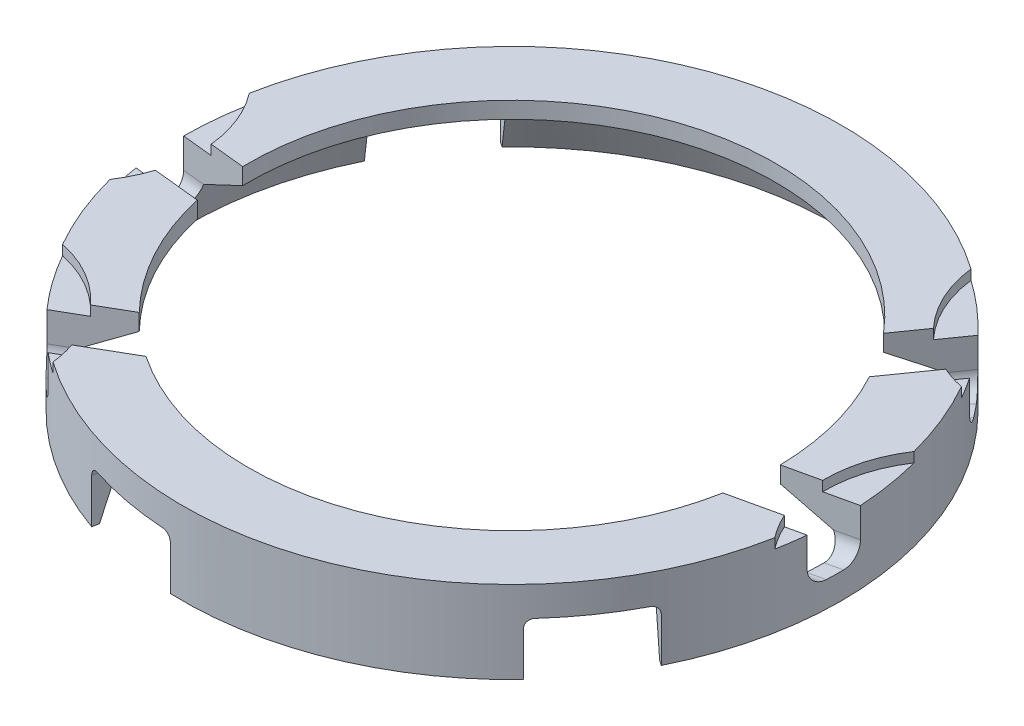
from build123d import *

# Parameters (mm, degrees)
CUT_EXTRUDE2_REACH = 307.713
CUT_EXTRUDE3_REACH = 293.287
CUT_EXTRUDE4_REACH = 298.591
CUT_EXTRUDE5_REACH = 309.152
CUT_EXTRUDE6_START = -3.81
SKETCH10_R         = 47.879
CUT_EXTRUDE6_DEPTH = 3.81
CUT_EXTRUDE7_DEPTH = 20.32
FILLET1_R          = 3.175


with BuildPart() as part:
    # Sketch2 → Revolve1 (revolve)
    with BuildSketch(Plane.XY, mode=Mode.PRIVATE) as revolve1_sk:
        Polygon((-101.6, 0), (-127, 0), (-127, -31.75), (-124.46, -31.75), (-118.450851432, -15.24), (-101.6, -6.35), align=None)
    revolve(revolve1_sk.sketch.rotate(Axis((0, 0, 0), (0, 1, 0)), 270), axis=Axis((0, 0, 0), (0, 1, 0)))

    # Sketch6 → Cut-Extrude2 (cut, up to next)
    with BuildSketch(Plane(origin=(-109.985226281, 0, 63.5), x_dir=(0.49999999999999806, 0, 0.8660254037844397), z_dir=(-0.8660254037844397, 0, 0.49999999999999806)), mode=Mode.PRIVATE) as cut_extrude2_sk1:
        with BuildLine():
            Line((24.918045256, 0), (44.476045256, 0))
            Line((44.476045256, 0), (44.476045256, -3.81))
            Line((44.476045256, -3.81), (44.476045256, -15.24))
            ThreePointArc((44.476045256, -15.24), (42.541778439, -19.909733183), (37.872045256, -21.844))
            Line((37.872045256, -21.844), (31.522045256, -21.844))
            ThreePointArc((31.522045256, -21.844), (26.852312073, -19.909733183), (24.918045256, -15.24))
            Line((24.918045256, -15.24), (24.918045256, -3.81))
            Line((24.918045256, -3.81), (24.918045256, 0))
        make_face()
    cut_extrude2_tool1 = extrude(cut_extrude2_sk1.sketch, amount=-CUT_EXTRUDE2_REACH, mode=Mode.PRIVATE) & part.part
    add(cut_extrude2_tool1.solids().sort_by_distance((-92.636704, -10.48912, 93.548523))[0], mode=Mode.SUBTRACT)

    # Sketch7 → Cut-Extrude3 (cut, up to next)
    with BuildSketch(Plane(origin=(-126.304280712, 0, -13.275114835), x_dir=(-0.10452846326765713, 0, 0.9945218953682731), z_dir=(-0.9945218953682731, 0, -0.10452846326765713)), mode=Mode.PRIVATE) as cut_extrude3_sk1:
        with BuildLine():
            Line((12.826833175, 0), (32.384833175, 0))
            Line((32.384833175, 0), (32.384833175, -3.81))
            Line((32.384833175, -3.81), (32.384833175, -15.24))
            ThreePointArc((32.384833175, -15.24), (30.450566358, -19.909733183), (25.780833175, -21.844))
            Line((25.780833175, -21.844), (19.430833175, -21.844))
            ThreePointArc((19.430833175, -21.844), (14.761099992, -19.909733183), (12.826833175, -15.24))
            Line((12.826833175, -15.24), (12.826833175, -3.81))
            Line((12.826833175, -3.81), (12.826833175, 0))
        make_face()
    cut_extrude3_tool1 = extrude(cut_extrude3_sk1.sketch, amount=-CUT_EXTRUDE3_REACH, mode=Mode.PRIVATE) & part.part
    add(cut_extrude3_tool1.solids().sort_by_distance((-128.667234, -10.48912, 9.206881))[0], mode=Mode.SUBTRACT)

    # Sketch8 → Cut-Extrude4 (cut, up to next)
    with BuildSketch(Plane(origin=(123.880999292, 0, -27.973165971), x_dir=(-0.22026114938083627, 0, -0.9754409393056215), z_dir=(0.9754409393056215, 0, -0.22026114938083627)), mode=Mode.PRIVATE) as cut_extrude4_sk1:
        with BuildLine():
            Line((-40.149833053, 0), (-20.591833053, 0))
            Line((-20.591833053, 0), (-20.591833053, -3.81))
            Line((-20.591833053, -3.81), (-20.591833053, -15.24))
            ThreePointArc((-20.591833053, -15.24), (-22.52609987, -19.909733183), (-27.195833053, -21.844))
            Line((-27.195833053, -21.844), (-33.545833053, -21.844))
            ThreePointArc((-33.545833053, -21.844), (-38.215566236, -19.909733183), (-40.149833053, -15.24))
            Line((-40.149833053, -15.24), (-40.149833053, -3.81))
            Line((-40.149833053, -3.81), (-40.149833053, 0))
        make_face()
    cut_extrude4_tool1 = extrude(cut_extrude4_sk1.sketch, amount=-CUT_EXTRUDE4_REACH, mode=Mode.PRIVATE) & part.part
    add(cut_extrude4_tool1.solids().sort_by_distance((130.570514, -10.48912, 1.651788))[0], mode=Mode.SUBTRACT)

    # Sketch9 → Cut-Extrude5 (cut, up to next)
    with BuildSketch(Plane(origin=(73.117065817, 0, -103.840717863), x_dir=(-0.817643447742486, 0, -0.5757249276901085), z_dir=(0.5757249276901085, 0, -0.8176434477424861)), mode=Mode.PRIVATE) as cut_extrude5_sk1:
        with BuildLine():
            Line((-45.170556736, 0), (-25.612556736, 0))
            Line((-25.612556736, 0), (-25.612556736, -3.81))
            Line((-25.612556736, -3.81), (-25.612556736, -15.24))
            ThreePointArc((-25.612556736, -15.24), (-27.546823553, -19.909733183), (-32.216556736, -21.844))
            Line((-32.216556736, -21.844), (-38.566556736, -21.844))
            ThreePointArc((-38.566556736, -21.844), (-43.236289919, -19.909733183), (-45.170556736, -15.24))
            Line((-45.170556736, -15.24), (-45.170556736, -3.81))
            Line((-45.170556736, -3.81), (-45.170556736, 0))
        make_face()
    cut_extrude5_tool1 = extrude(cut_extrude5_sk1.sketch, amount=-CUT_EXTRUDE5_REACH, mode=Mode.PRIVATE) & part.part
    add(cut_extrude5_tool1.solids().sort_by_distance((102.05474, -10.48912, -83.464916))[0], mode=Mode.SUBTRACT)

    # Sketch10 → Cut-Extrude6 (cut)
    with BuildSketch(Plane(origin=(0, 0, 0), x_dir=(1, 0, 0), z_dir=(0, 1, 0)).offset(CUT_EXTRUDE6_START)):
        with Locations((-162.780464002, -5.621436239)):
            Circle(SKETCH10_R)
        with Locations((-120.46982264, -109.617981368)):
            Circle(SKETCH10_R)
        with Locations((162.780464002, 5.621436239)):
            Circle(SKETCH10_R)
        with Locations((120.46982264, 109.617981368)):
            Circle(SKETCH10_R)
    extrude(amount=CUT_EXTRUDE6_DEPTH, mode=Mode.SUBTRACT)

    # Sketch13 → Cut-Extrude7 (cut)
    with BuildSketch(Plane.XZ.offset(31.75)):
        Polygon((-44.131509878, 129.935100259), (-37.005388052, 92.507458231), (0.422253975, 99.633580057), (-6.70386785, 137.061222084), align=None)
        Polygon((100.486978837, 93.450989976), (69.255369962, 71.629060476), (91.077299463, 40.397451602), (122.308908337, 62.219381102), align=None)
        Polygon((44.131509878, -129.935100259), (37.005388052, -92.507458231), (-0.422253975, -99.633580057), (6.70386785, -137.061222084), align=None)
        Polygon((-100.486978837, -93.450989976), (-69.255369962, -71.629060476), (-91.077299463, -40.397451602), (-122.308908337, -62.219381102), align=None)
    extrude(amount=-CUT_EXTRUDE7_DEPTH, mode=Mode.SUBTRACT)

    # Fillet1
    fillet1_edges = [part.edges().sort_by_distance(p)[0] for p in [
        (-3.276970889, -11.43, 119.062558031),
        (107.289868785, -11.43, 51.725383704),
        (40.704612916, -11.43, -111.936436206),
        (-85.467939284, -11.43, -82.956992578),
        (3.276970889, -11.43, -119.062558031),
        (85.467939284, -11.43, 82.956992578),
        (-107.289868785, -11.43, -51.725383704),
        (-40.704612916, -11.43, 111.936436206),
    ]]
    fillet(fillet1_edges, radius=FILLET1_R)


solid = part.part
